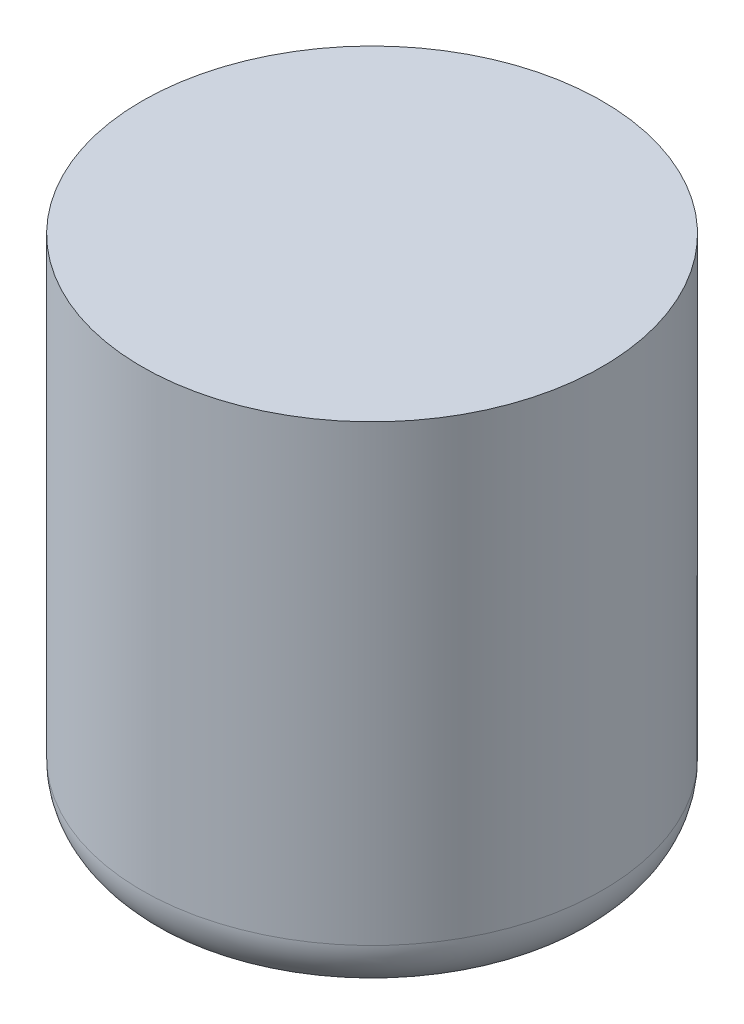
ISO-10303-21;
HEADER;
FILE_DESCRIPTION(('STEP AP214'),'2;1');
FILE_NAME('part.step','',(''),(''),'','','');
FILE_SCHEMA(('AUTOMOTIVE_DESIGN { 1 0 10303 214 1 1 1 1 }'));
ENDSEC;
DATA;
#1=APPLICATION_CONTEXT('core data for automotive mechanical design processes');
#2=APPLICATION_PROTOCOL_DEFINITION('international standard','automotive_design',2000,#1);
#3=PRODUCT_CONTEXT('',#1,'mechanical');
#4=PRODUCT('Part','Part','',(#3));
#5=PRODUCT_RELATED_PRODUCT_CATEGORY('part','',(#4));
#6=PRODUCT_DEFINITION_FORMATION('','',#4);
#7=PRODUCT_DEFINITION_CONTEXT('part definition',#1,'design');
#8=PRODUCT_DEFINITION('design','',#6,#7);
#9=PRODUCT_DEFINITION_SHAPE('','',#8);
#10=(LENGTH_UNIT() NAMED_UNIT(*) SI_UNIT(.MILLI.,.METRE.));
#11=(NAMED_UNIT(*) PLANE_ANGLE_UNIT() SI_UNIT($,.RADIAN.));
#12=(NAMED_UNIT(*) SI_UNIT($,.STERADIAN.) SOLID_ANGLE_UNIT());
#13=UNCERTAINTY_MEASURE_WITH_UNIT(LENGTH_MEASURE(1.E-05),#10,'distance_accuracy_value','');
#14=(GEOMETRIC_REPRESENTATION_CONTEXT(3) GLOBAL_UNCERTAINTY_ASSIGNED_CONTEXT((#13)) GLOBAL_UNIT_ASSIGNED_CONTEXT((#10,
#11,#12)) REPRESENTATION_CONTEXT('',''));
#15=CARTESIAN_POINT('',(0.,0.,0.));
#16=DIRECTION('',(0.,0.,1.));
#17=DIRECTION('',(1.,0.,0.));
#18=AXIS2_PLACEMENT_3D('',#15,#16,#17);
#19=CARTESIAN_POINT('',(-70.9186877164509,54.6389066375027,0.));
#20=DIRECTION('',(0.,1.,0.));
#21=DIRECTION('',(-1.,0.,0.));
#22=AXIS2_PLACEMENT_3D('',#19,#20,#21);
#23=TOROIDAL_SURFACE('',#22,37.09,12.);
#24=CARTESIAN_POINT('',(-70.9186877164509,46.1489066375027,0.));
#25=DIRECTION('',(0.,1.,0.));
#26=DIRECTION('',(-1.,0.,0.));
#27=AXIS2_PLACEMENT_3D('',#24,#25,#26);
#28=CIRCLE('',#27,45.5705601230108);
#29=CARTESIAN_POINT('',(-116.489247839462,46.1489066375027,0.));
#30=VERTEX_POINT('',#29);
#31=EDGE_CURVE('E10',#30,#30,#28,.T.);
#32=ORIENTED_EDGE('',*,*,#31,.T.);
#33=EDGE_LOOP('',(#32));
#34=FACE_BOUND('',#33,.T.);
#35=CARTESIAN_POINT('',(-70.9186877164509,54.6389066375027,0.));
#36=DIRECTION('',(0.,1.,0.));
#37=DIRECTION('',(-1.,0.,0.));
#38=AXIS2_PLACEMENT_3D('',#35,#36,#37);
#39=CIRCLE('',#38,49.09);
#40=CARTESIAN_POINT('',(-120.008687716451,54.6389066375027,0.));
#41=VERTEX_POINT('',#40);
#42=EDGE_CURVE('E40',#41,#41,#39,.T.);
#43=ORIENTED_EDGE('',*,*,#42,.F.);
#44=EDGE_LOOP('',(#43));
#45=FACE_BOUND('',#44,.T.);
#46=ADVANCED_FACE('F30',(#34,#45),#23,.T.);
#47=CARTESIAN_POINT('',(-116.489247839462,46.1489066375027,0.));
#48=DIRECTION('',(0.,-1.,0.));
#49=DIRECTION('',(1.,0.,0.));
#50=AXIS2_PLACEMENT_3D('',#47,#48,#49);
#51=PLANE('',#50);
#52=ORIENTED_EDGE('',*,*,#31,.F.);
#53=EDGE_LOOP('',(#52));
#54=FACE_BOUND('',#53,.T.);
#55=ADVANCED_FACE('F51',(#54),#51,.T.);
#56=CARTESIAN_POINT('',(-120.008687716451,151.378906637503,0.));
#57=DIRECTION('',(0.,1.,0.));
#58=DIRECTION('',(-1.,0.,0.));
#59=AXIS2_PLACEMENT_3D('',#56,#57,#58);
#60=PLANE('',#59);
#61=CARTESIAN_POINT('',(-70.9186877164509,151.378906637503,0.));
#62=DIRECTION('',(0.,1.,0.));
#63=DIRECTION('',(-1.,0.,0.));
#64=AXIS2_PLACEMENT_3D('',#61,#62,#63);
#65=CIRCLE('',#64,49.09);
#66=CARTESIAN_POINT('',(-120.008687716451,151.378906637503,0.));
#67=VERTEX_POINT('',#66);
#68=EDGE_CURVE('E36',#67,#67,#65,.T.);
#69=ORIENTED_EDGE('',*,*,#68,.T.);
#70=EDGE_LOOP('',(#69));
#71=FACE_BOUND('',#70,.T.);
#72=ADVANCED_FACE('F55',(#71),#60,.T.);
#73=CARTESIAN_POINT('',(-70.9186877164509,164.899410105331,0.));
#74=DIRECTION('',(0.,1.,0.));
#75=DIRECTION('',(-1.,0.,0.));
#76=AXIS2_PLACEMENT_3D('',#73,#74,#75);
#77=CYLINDRICAL_SURFACE('',#76,49.09);
#78=ORIENTED_EDGE('',*,*,#42,.T.);
#79=EDGE_LOOP('',(#78));
#80=FACE_BOUND('',#79,.T.);
#81=ORIENTED_EDGE('',*,*,#68,.F.);
#82=EDGE_LOOP('',(#81));
#83=FACE_BOUND('',#82,.T.);
#84=ADVANCED_FACE('F47',(#80,#83),#77,.T.);
#85=CLOSED_SHELL('',(#46,#55,#72,#84));
#86=MANIFOLD_SOLID_BREP('B2',#85);
#87=ADVANCED_BREP_SHAPE_REPRESENTATION('',(#18,#86),#14);
#88=SHAPE_DEFINITION_REPRESENTATION(#9,#87);
ENDSEC;
END-ISO-10303-21;
